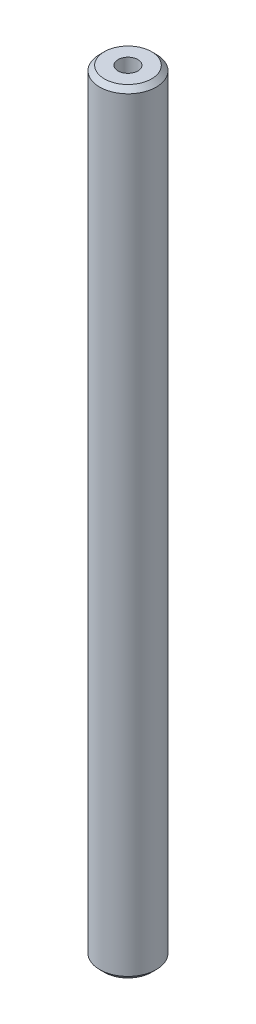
from build123d import *

# Parameters (mm, degrees)
SKETCH1_R                 = 6
EXTRUDE1_DEPTH            = 164
CHAMFER1_SIZE             = 1
M5X0_8_TAPPED_HOLE1_D     = 4.2
M5X0_8_TAPPED_HOLE1_DEPTH = 12.4
M5X0_8_TAPPED_HOLE1_TIP   = 1.2618073
M5X0_8_TAPPED_HOLE2_D     = 4.2
M5X0_8_TAPPED_HOLE2_DEPTH = 12.4
M5X0_8_TAPPED_HOLE2_TIP   = 1.2618073


with BuildPart() as part:
    # Sketch1 → Extrude1 (new body)
    with BuildSketch(Plane(origin=(0, 0, 0), x_dir=(1, 0, 0), z_dir=(0, 1, 0))):
        with Locations(Location((0, 0, 0), (0, 0, 270))):
            Circle(SKETCH1_R)
    extrude(amount=EXTRUDE1_DEPTH)

    # Chamfer1
    chamfer1_edges = [part.edges().sort_by_distance(p)[0] for p in [
        (0, 0, -6),
        (0, 164, -6),
    ]]
    chamfer(chamfer1_edges, length=CHAMFER1_SIZE)

    # M5x0.8 Tapped Hole1
    with Locations(Plane(origin=(0, 164, 0), x_dir=(-1, 0, 0), z_dir=(0, 1, 0))):
        with Locations((0, 0)):
            Hole(M5X0_8_TAPPED_HOLE1_D / 2, depth=M5X0_8_TAPPED_HOLE1_DEPTH)
            with Locations((0, 0, -(M5X0_8_TAPPED_HOLE1_DEPTH + M5X0_8_TAPPED_HOLE1_TIP / 2))):  # 118° drill point
                Cone(0, M5X0_8_TAPPED_HOLE1_D / 2, M5X0_8_TAPPED_HOLE1_TIP, mode=Mode.SUBTRACT)

    # M5x0.8 Tapped Hole2
    with Locations(Plane.XZ):
        with Locations((0, 0)):
            Hole(M5X0_8_TAPPED_HOLE2_D / 2, depth=M5X0_8_TAPPED_HOLE2_DEPTH)
            with Locations((0, 0, -(M5X0_8_TAPPED_HOLE2_DEPTH + M5X0_8_TAPPED_HOLE2_TIP / 2))):  # 118° drill point
                Cone(0, M5X0_8_TAPPED_HOLE2_D / 2, M5X0_8_TAPPED_HOLE2_TIP, mode=Mode.SUBTRACT)


solid = part.part
